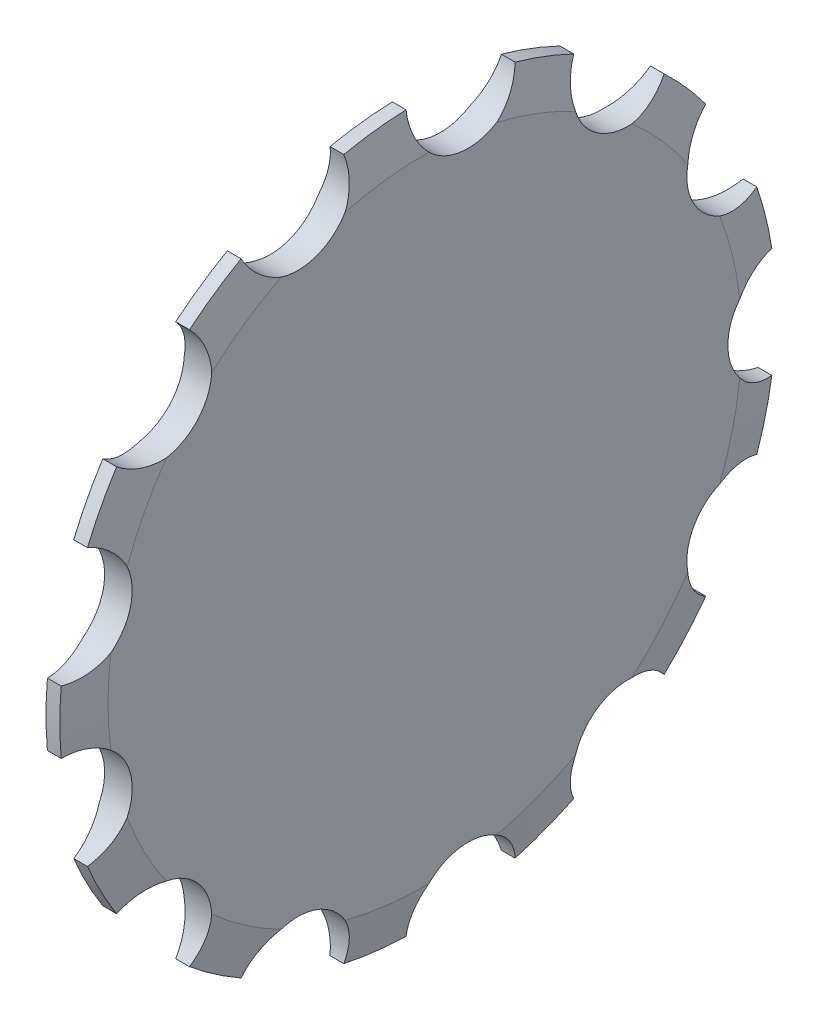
from build123d import *

# Parameters (mm, degrees)
ESQUISSE2_R             = 4
ENL_V_MAT_EXTRU_1_DEPTH = 37.823905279


with BuildPart() as part:
    # Esquisse1 → Base-R_volution (revolve)
    with BuildSketch(Plane.XY):
        Polygon((-1, 0), (1, 0), (1, 23), (0.5, 26), (-0.5, 26), (-1, 23), align=None)
    revolve(axis=Axis((-40, 0, 0), (1, 0, 0)))

    # Esquisse2 → Enl_v. mat.-Extru.1 (cut, through all)
    with BuildSketch(Plane(origin=(1, 0, 0), x_dir=(0, 0, -1), z_dir=(1, 0, 0))):
        with Locations((26, 0)):
            Circle(ESQUISSE2_R)
        with Locations((23.021856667, -12.082802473)):
            Circle(ESQUISSE2_R)
        with Locations((14.769683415, -21.397580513)):
            Circle(ESQUISSE2_R)
        with Locations((3.133953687, -25.810430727)):
            Circle(ESQUISSE2_R)
        with Locations((-9.219727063, -24.31042231)):
            Circle(ESQUISSE2_R)
        with Locations((-19.461279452, -17.241189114)):
            Circle(ESQUISSE2_R)
        with Locations((-25.244487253, -6.222207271)):
            Circle(ESQUISSE2_R)
        with Locations((-25.244487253, 6.222207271)):
            Circle(ESQUISSE2_R)
        with Locations((-19.461279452, 17.241189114)):
            Circle(ESQUISSE2_R)
        with Locations((-9.219727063, 24.31042231)):
            Circle(ESQUISSE2_R)
        with Locations((3.133953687, 25.810430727)):
            Circle(ESQUISSE2_R)
        with Locations((14.769683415, 21.397580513)):
            Circle(ESQUISSE2_R)
        with Locations((23.021856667, 12.082802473)):
            Circle(ESQUISSE2_R)
    extrude(amount=-ENL_V_MAT_EXTRU_1_DEPTH, mode=Mode.SUBTRACT)


solid = part.part
